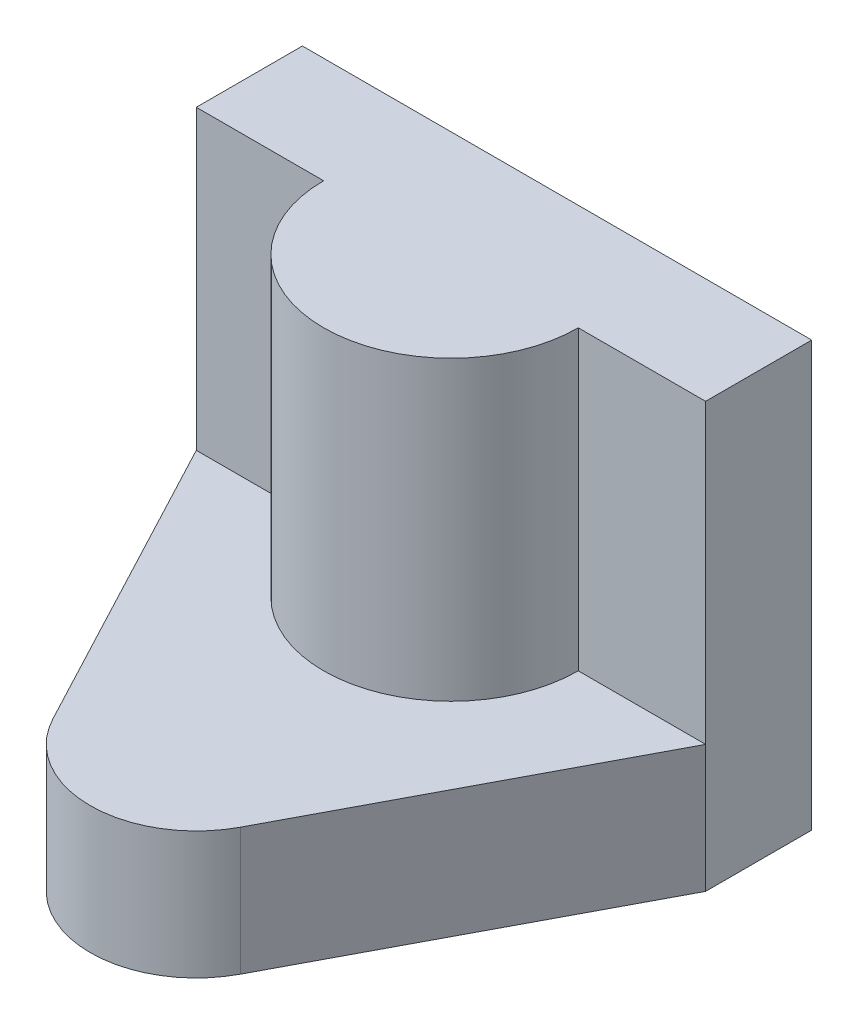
ISO-10303-21;
HEADER;
FILE_DESCRIPTION(('STEP AP214'),'2;1');
FILE_NAME('part.step','',(''),(''),'','','');
FILE_SCHEMA(('AUTOMOTIVE_DESIGN { 1 0 10303 214 1 1 1 1 }'));
ENDSEC;
DATA;
#1=APPLICATION_CONTEXT('core data for automotive mechanical design processes');
#2=APPLICATION_PROTOCOL_DEFINITION('international standard','automotive_design',2000,#1);
#3=PRODUCT_CONTEXT('',#1,'mechanical');
#4=PRODUCT('Part','Part','',(#3));
#5=PRODUCT_RELATED_PRODUCT_CATEGORY('part','',(#4));
#6=PRODUCT_DEFINITION_FORMATION('','',#4);
#7=PRODUCT_DEFINITION_CONTEXT('part definition',#1,'design');
#8=PRODUCT_DEFINITION('design','',#6,#7);
#9=PRODUCT_DEFINITION_SHAPE('','',#8);
#10=(LENGTH_UNIT() NAMED_UNIT(*) SI_UNIT(.MILLI.,.METRE.));
#11=(NAMED_UNIT(*) PLANE_ANGLE_UNIT() SI_UNIT($,.RADIAN.));
#12=(NAMED_UNIT(*) SI_UNIT($,.STERADIAN.) SOLID_ANGLE_UNIT());
#13=UNCERTAINTY_MEASURE_WITH_UNIT(LENGTH_MEASURE(1.E-05),#10,'distance_accuracy_value','');
#14=(GEOMETRIC_REPRESENTATION_CONTEXT(3) GLOBAL_UNCERTAINTY_ASSIGNED_CONTEXT((#13)) GLOBAL_UNIT_ASSIGNED_CONTEXT((#10,
#11,#12)) REPRESENTATION_CONTEXT('',''));
#15=CARTESIAN_POINT('',(0.,0.,0.));
#16=DIRECTION('',(0.,0.,1.));
#17=DIRECTION('',(1.,0.,0.));
#18=AXIS2_PLACEMENT_3D('',#15,#16,#17);
#19=CARTESIAN_POINT('',(-120.807449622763,100.,0.));
#20=DIRECTION('',(0.,0.,-1.));
#21=DIRECTION('',(-1.,0.,0.));
#22=AXIS2_PLACEMENT_3D('',#19,#20,#21);
#23=PLANE('',#22);
#24=DIRECTION('',(1.,0.,0.));
#25=VECTOR('',#24,1.);
#26=CARTESIAN_POINT('',(-120.807449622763,0.,0.));
#27=LINE('',#26,#25);
#28=CARTESIAN_POINT('',(-60.,0.,0.));
#29=VERTEX_POINT('',#28);
#30=CARTESIAN_POINT('',(60.,0.,0.));
#31=VERTEX_POINT('',#30);
#32=EDGE_CURVE('E115',#29,#31,#27,.T.);
#33=ORIENTED_EDGE('',*,*,#32,.F.);
#34=DIRECTION('',(0.,-1.,0.));
#35=VECTOR('',#34,1.);
#36=CARTESIAN_POINT('',(-60.,100.,0.));
#37=LINE('',#36,#35);
#38=CARTESIAN_POINT('',(-60.,100.,0.));
#39=VERTEX_POINT('',#38);
#40=EDGE_CURVE('E11',#39,#29,#37,.T.);
#41=ORIENTED_EDGE('',*,*,#40,.F.);
#42=DIRECTION('',(1.,0.,0.));
#43=VECTOR('',#42,1.);
#44=CARTESIAN_POINT('',(-120.807449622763,100.,0.));
#45=LINE('',#44,#43);
#46=CARTESIAN_POINT('',(60.,100.,0.));
#47=VERTEX_POINT('',#46);
#48=EDGE_CURVE('E123',#39,#47,#45,.T.);
#49=ORIENTED_EDGE('',*,*,#48,.T.);
#50=DIRECTION('',(0.,-1.,0.));
#51=VECTOR('',#50,1.);
#52=CARTESIAN_POINT('',(60.,100.,0.));
#53=LINE('',#52,#51);
#54=EDGE_CURVE('E46',#47,#31,#53,.T.);
#55=ORIENTED_EDGE('',*,*,#54,.T.);
#56=EDGE_LOOP('',(#33,#41,#49,#55));
#57=FACE_BOUND('',#56,.T.);
#58=ADVANCED_FACE('F30',(#57),#23,.T.);
#59=CARTESIAN_POINT('',(-60.,100.,48.8575845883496));
#60=DIRECTION('',(-1.,0.,0.));
#61=DIRECTION('',(0.,0.,1.));
#62=AXIS2_PLACEMENT_3D('',#59,#60,#61);
#63=PLANE('',#62);
#64=DIRECTION('',(0.,0.,-1.));
#65=VECTOR('',#64,1.);
#66=CARTESIAN_POINT('',(-60.,0.,48.8575845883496));
#67=LINE('',#66,#65);
#68=CARTESIAN_POINT('',(-60.,0.,25.));
#69=VERTEX_POINT('',#68);
#70=EDGE_CURVE('E117',#69,#29,#67,.T.);
#71=ORIENTED_EDGE('',*,*,#70,.F.);
#72=DIRECTION('',(0.,-1.,0.));
#73=VECTOR('',#72,1.);
#74=CARTESIAN_POINT('',(-60.,30.,25.));
#75=LINE('',#74,#73);
#76=CARTESIAN_POINT('',(-60.,30.,25.));
#77=VERTEX_POINT('',#76);
#78=EDGE_CURVE('E141',#77,#69,#75,.T.);
#79=ORIENTED_EDGE('',*,*,#78,.F.);
#80=DIRECTION('',(0.,-1.,0.));
#81=VECTOR('',#80,1.);
#82=CARTESIAN_POINT('',(-60.,100.,25.));
#83=LINE('',#82,#81);
#84=CARTESIAN_POINT('',(-60.,100.,25.));
#85=VERTEX_POINT('',#84);
#86=EDGE_CURVE('E38',#85,#77,#83,.T.);
#87=ORIENTED_EDGE('',*,*,#86,.F.);
#88=DIRECTION('',(0.,0.,-1.));
#89=VECTOR('',#88,1.);
#90=CARTESIAN_POINT('',(-60.,100.,48.8575845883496));
#91=LINE('',#90,#89);
#92=EDGE_CURVE('E140',#85,#39,#91,.T.);
#93=ORIENTED_EDGE('',*,*,#92,.T.);
#94=ORIENTED_EDGE('',*,*,#40,.T.);
#95=EDGE_LOOP('',(#71,#79,#87,#93,#94));
#96=FACE_BOUND('',#95,.T.);
#97=ADVANCED_FACE('F139',(#96),#63,.T.);
#98=CARTESIAN_POINT('',(-120.807449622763,100.,25.));
#99=DIRECTION('',(0.,0.,1.));
#100=DIRECTION('',(1.,0.,0.));
#101=AXIS2_PLACEMENT_3D('',#98,#99,#100);
#102=PLANE('',#101);
#103=DIRECTION('',(-1.,0.,0.));
#104=VECTOR('',#103,1.);
#105=CARTESIAN_POINT('',(-120.807449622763,30.,25.));
#106=LINE('',#105,#104);
#107=CARTESIAN_POINT('',(-30.,30.,25.));
#108=VERTEX_POINT('',#107);
#109=EDGE_CURVE('E133',#108,#77,#106,.T.);
#110=ORIENTED_EDGE('',*,*,#109,.F.);
#111=DIRECTION('',(0.,-1.,0.));
#112=VECTOR('',#111,1.);
#113=CARTESIAN_POINT('',(-30.,100.,25.));
#114=LINE('',#113,#112);
#115=CARTESIAN_POINT('',(-30.,100.,25.));
#116=VERTEX_POINT('',#115);
#117=EDGE_CURVE('E95',#116,#108,#114,.T.);
#118=ORIENTED_EDGE('',*,*,#117,.F.);
#119=DIRECTION('',(-1.,0.,0.));
#120=VECTOR('',#119,1.);
#121=CARTESIAN_POINT('',(-120.807449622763,100.,25.));
#122=LINE('',#121,#120);
#123=EDGE_CURVE('E106',#116,#85,#122,.T.);
#124=ORIENTED_EDGE('',*,*,#123,.T.);
#125=ORIENTED_EDGE('',*,*,#86,.T.);
#126=EDGE_LOOP('',(#110,#118,#124,#125));
#127=FACE_BOUND('',#126,.T.);
#128=ADVANCED_FACE('F130',(#127),#102,.T.);
#129=CARTESIAN_POINT('',(0.,100.,25.));
#130=DIRECTION('',(0.,-1.,0.));
#131=DIRECTION('',(0.,0.,-1.));
#132=AXIS2_PLACEMENT_3D('',#129,#130,#131);
#133=CYLINDRICAL_SURFACE('',#132,30.);
#134=CARTESIAN_POINT('',(0.,30.,25.));
#135=DIRECTION('',(0.,1.,0.));
#136=DIRECTION('',(0.,0.,1.));
#137=AXIS2_PLACEMENT_3D('',#134,#135,#136);
#138=CIRCLE('',#137,30.);
#139=CARTESIAN_POINT('',(30.,30.,25.));
#140=VERTEX_POINT('',#139);
#141=EDGE_CURVE('E91',#140,#108,#138,.F.);
#142=ORIENTED_EDGE('',*,*,#141,.F.);
#143=DIRECTION('',(0.,-1.,0.));
#144=VECTOR('',#143,1.);
#145=CARTESIAN_POINT('',(30.,100.,25.));
#146=LINE('',#145,#144);
#147=CARTESIAN_POINT('',(30.,100.,25.));
#148=VERTEX_POINT('',#147);
#149=EDGE_CURVE('E84',#148,#140,#146,.T.);
#150=ORIENTED_EDGE('',*,*,#149,.F.);
#151=CARTESIAN_POINT('',(0.,100.,25.));
#152=DIRECTION('',(0.,1.,0.));
#153=DIRECTION('',(0.,0.,1.));
#154=AXIS2_PLACEMENT_3D('',#151,#152,#153);
#155=CIRCLE('',#154,30.);
#156=EDGE_CURVE('E88',#148,#116,#155,.F.);
#157=ORIENTED_EDGE('',*,*,#156,.T.);
#158=ORIENTED_EDGE('',*,*,#117,.T.);
#159=EDGE_LOOP('',(#142,#150,#157,#158));
#160=FACE_BOUND('',#159,.T.);
#161=ADVANCED_FACE('F86',(#160),#133,.T.);
#162=CARTESIAN_POINT('',(-120.807449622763,100.,25.));
#163=DIRECTION('',(0.,0.,1.));
#164=DIRECTION('',(1.,0.,0.));
#165=AXIS2_PLACEMENT_3D('',#162,#163,#164);
#166=PLANE('',#165);
#167=DIRECTION('',(-1.,0.,0.));
#168=VECTOR('',#167,1.);
#169=CARTESIAN_POINT('',(-120.807449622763,30.,25.));
#170=LINE('',#169,#168);
#171=CARTESIAN_POINT('',(60.,30.,25.));
#172=VERTEX_POINT('',#171);
#173=EDGE_CURVE('E167',#172,#140,#170,.T.);
#174=ORIENTED_EDGE('',*,*,#173,.F.);
#175=DIRECTION('',(0.,-1.,0.));
#176=VECTOR('',#175,1.);
#177=CARTESIAN_POINT('',(60.,100.,25.));
#178=LINE('',#177,#176);
#179=CARTESIAN_POINT('',(60.,100.,25.));
#180=VERTEX_POINT('',#179);
#181=EDGE_CURVE('E96',#180,#172,#178,.T.);
#182=ORIENTED_EDGE('',*,*,#181,.F.);
#183=DIRECTION('',(-1.,0.,0.));
#184=VECTOR('',#183,1.);
#185=CARTESIAN_POINT('',(-120.807449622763,100.,25.));
#186=LINE('',#185,#184);
#187=EDGE_CURVE('E103',#180,#148,#186,.T.);
#188=ORIENTED_EDGE('',*,*,#187,.T.);
#189=ORIENTED_EDGE('',*,*,#149,.T.);
#190=EDGE_LOOP('',(#174,#182,#188,#189));
#191=FACE_BOUND('',#190,.T.);
#192=ADVANCED_FACE('F108',(#191),#166,.T.);
#193=CARTESIAN_POINT('',(60.,100.,48.8575845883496));
#194=DIRECTION('',(1.,0.,0.));
#195=DIRECTION('',(0.,0.,-1.));
#196=AXIS2_PLACEMENT_3D('',#193,#194,#195);
#197=PLANE('',#196);
#198=DIRECTION('',(0.,0.,1.));
#199=VECTOR('',#198,1.);
#200=CARTESIAN_POINT('',(60.,0.,48.8575845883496));
#201=LINE('',#200,#199);
#202=CARTESIAN_POINT('',(60.,0.,25.));
#203=VERTEX_POINT('',#202);
#204=EDGE_CURVE('E120',#31,#203,#201,.T.);
#205=ORIENTED_EDGE('',*,*,#204,.F.);
#206=ORIENTED_EDGE('',*,*,#54,.F.);
#207=DIRECTION('',(0.,0.,1.));
#208=VECTOR('',#207,1.);
#209=CARTESIAN_POINT('',(60.,100.,48.8575845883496));
#210=LINE('',#209,#208);
#211=EDGE_CURVE('E110',#47,#180,#210,.T.);
#212=ORIENTED_EDGE('',*,*,#211,.T.);
#213=ORIENTED_EDGE('',*,*,#181,.T.);
#214=DIRECTION('',(0.,-1.,0.));
#215=VECTOR('',#214,1.);
#216=CARTESIAN_POINT('',(60.,30.,25.));
#217=LINE('',#216,#215);
#218=EDGE_CURVE('E147',#172,#203,#217,.T.);
#219=ORIENTED_EDGE('',*,*,#218,.T.);
#220=EDGE_LOOP('',(#205,#206,#212,#213,#219));
#221=FACE_BOUND('',#220,.T.);
#222=ADVANCED_FACE('F197',(#221),#197,.T.);
#223=CARTESIAN_POINT('',(-120.807449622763,100.,48.8575845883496));
#224=DIRECTION('',(0.,1.,0.));
#225=DIRECTION('',(0.,0.,1.));
#226=AXIS2_PLACEMENT_3D('',#223,#224,#225);
#227=PLANE('',#226);
#228=ORIENTED_EDGE('',*,*,#48,.F.);
#229=ORIENTED_EDGE('',*,*,#92,.F.);
#230=ORIENTED_EDGE('',*,*,#123,.F.);
#231=ORIENTED_EDGE('',*,*,#156,.F.);
#232=ORIENTED_EDGE('',*,*,#187,.F.);
#233=ORIENTED_EDGE('',*,*,#211,.F.);
#234=EDGE_LOOP('',(#228,#229,#230,#231,#232,#233));
#235=FACE_BOUND('',#234,.T.);
#236=ADVANCED_FACE('F101',(#235),#227,.T.);
#237=CARTESIAN_POINT('',(-120.807449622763,0.,48.8575845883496));
#238=DIRECTION('',(0.,1.,0.));
#239=DIRECTION('',(0.,0.,1.));
#240=AXIS2_PLACEMENT_3D('',#237,#238,#239);
#241=PLANE('',#240);
#242=ORIENTED_EDGE('',*,*,#32,.T.);
#243=ORIENTED_EDGE('',*,*,#204,.T.);
#244=DIRECTION('',(0.467386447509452,0.,-0.884053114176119));
#245=VECTOR('',#244,1.);
#246=CARTESIAN_POINT('',(10.6447747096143,0.,118.354526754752));
#247=LINE('',#246,#245);
#248=CARTESIAN_POINT('',(22.101327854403,0.,96.6846611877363));
#249=VERTEX_POINT('',#248);
#250=EDGE_CURVE('E157',#249,#203,#247,.T.);
#251=ORIENTED_EDGE('',*,*,#250,.F.);
#252=CARTESIAN_POINT('',(0.,0.,85.));
#253=DIRECTION('',(0.,1.,0.));
#254=DIRECTION('',(0.,0.,1.));
#255=AXIS2_PLACEMENT_3D('',#252,#253,#254);
#256=CIRCLE('',#255,25.);
#257=CARTESIAN_POINT('',(-22.101327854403,0.,96.6846611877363));
#258=VERTEX_POINT('',#257);
#259=EDGE_CURVE('E160',#258,#249,#256,.T.);
#260=ORIENTED_EDGE('',*,*,#259,.F.);
#261=DIRECTION('',(0.467386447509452,0.,0.884053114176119));
#262=VECTOR('',#261,1.);
#263=CARTESIAN_POINT('',(-63.4255715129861,0.,18.5205926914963));
#264=LINE('',#263,#262);
#265=EDGE_CURVE('E61',#69,#258,#264,.T.);
#266=ORIENTED_EDGE('',*,*,#265,.F.);
#267=ORIENTED_EDGE('',*,*,#70,.T.);
#268=EDGE_LOOP('',(#242,#243,#251,#260,#266,#267));
#269=FACE_BOUND('',#268,.T.);
#270=ADVANCED_FACE('F198',(#269),#241,.F.);
#271=CARTESIAN_POINT('',(0.,30.,85.));
#272=DIRECTION('',(0.,-1.,0.));
#273=DIRECTION('',(0.,0.,-1.));
#274=AXIS2_PLACEMENT_3D('',#271,#272,#273);
#275=CYLINDRICAL_SURFACE('',#274,25.);
#276=ORIENTED_EDGE('',*,*,#259,.T.);
#277=DIRECTION('',(0.,-1.,0.));
#278=VECTOR('',#277,1.);
#279=CARTESIAN_POINT('',(22.101327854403,30.,96.6846611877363));
#280=LINE('',#279,#278);
#281=CARTESIAN_POINT('',(22.101327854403,30.,96.6846611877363));
#282=VERTEX_POINT('',#281);
#283=EDGE_CURVE('E118',#282,#249,#280,.T.);
#284=ORIENTED_EDGE('',*,*,#283,.F.);
#285=CARTESIAN_POINT('',(0.,30.,85.));
#286=DIRECTION('',(0.,1.,0.));
#287=DIRECTION('',(0.,0.,1.));
#288=AXIS2_PLACEMENT_3D('',#285,#286,#287);
#289=CIRCLE('',#288,25.);
#290=CARTESIAN_POINT('',(-22.101327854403,30.,96.6846611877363));
#291=VERTEX_POINT('',#290);
#292=EDGE_CURVE('E156',#291,#282,#289,.T.);
#293=ORIENTED_EDGE('',*,*,#292,.F.);
#294=DIRECTION('',(0.,-1.,0.));
#295=VECTOR('',#294,1.);
#296=CARTESIAN_POINT('',(-22.101327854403,30.,96.6846611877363));
#297=LINE('',#296,#295);
#298=EDGE_CURVE('E151',#291,#258,#297,.T.);
#299=ORIENTED_EDGE('',*,*,#298,.T.);
#300=EDGE_LOOP('',(#276,#284,#293,#299));
#301=FACE_BOUND('',#300,.T.);
#302=ADVANCED_FACE('F186',(#301),#275,.T.);
#303=CARTESIAN_POINT('',(10.6447747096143,30.,118.354526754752));
#304=DIRECTION('',(-0.884053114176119,0.,-0.467386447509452));
#305=DIRECTION('',(-0.467386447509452,0.,0.884053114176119));
#306=AXIS2_PLACEMENT_3D('',#303,#304,#305);
#307=PLANE('',#306);
#308=ORIENTED_EDGE('',*,*,#250,.T.);
#309=ORIENTED_EDGE('',*,*,#218,.F.);
#310=DIRECTION('',(0.467386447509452,0.,-0.884053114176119));
#311=VECTOR('',#310,1.);
#312=CARTESIAN_POINT('',(10.6447747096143,30.,118.354526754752));
#313=LINE('',#312,#311);
#314=EDGE_CURVE('E170',#282,#172,#313,.T.);
#315=ORIENTED_EDGE('',*,*,#314,.F.);
#316=ORIENTED_EDGE('',*,*,#283,.T.);
#317=EDGE_LOOP('',(#308,#309,#315,#316));
#318=FACE_BOUND('',#317,.T.);
#319=ADVANCED_FACE('F189',(#318),#307,.F.);
#320=CARTESIAN_POINT('',(-63.4255715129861,30.,18.5205926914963));
#321=DIRECTION('',(0.884053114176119,0.,-0.467386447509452));
#322=DIRECTION('',(-0.467386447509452,0.,-0.884053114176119));
#323=AXIS2_PLACEMENT_3D('',#320,#321,#322);
#324=PLANE('',#323);
#325=ORIENTED_EDGE('',*,*,#265,.T.);
#326=ORIENTED_EDGE('',*,*,#298,.F.);
#327=DIRECTION('',(0.467386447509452,0.,0.884053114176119));
#328=VECTOR('',#327,1.);
#329=CARTESIAN_POINT('',(-63.4255715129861,30.,18.5205926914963));
#330=LINE('',#329,#328);
#331=EDGE_CURVE('E154',#77,#291,#330,.T.);
#332=ORIENTED_EDGE('',*,*,#331,.F.);
#333=ORIENTED_EDGE('',*,*,#78,.T.);
#334=EDGE_LOOP('',(#325,#326,#332,#333));
#335=FACE_BOUND('',#334,.T.);
#336=ADVANCED_FACE('F222',(#335),#324,.F.);
#337=CARTESIAN_POINT('',(-120.807449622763,30.,48.8575845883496));
#338=DIRECTION('',(0.,1.,0.));
#339=DIRECTION('',(0.,0.,1.));
#340=AXIS2_PLACEMENT_3D('',#337,#338,#339);
#341=PLANE('',#340);
#342=ORIENTED_EDGE('',*,*,#292,.T.);
#343=ORIENTED_EDGE('',*,*,#314,.T.);
#344=ORIENTED_EDGE('',*,*,#173,.T.);
#345=ORIENTED_EDGE('',*,*,#141,.T.);
#346=ORIENTED_EDGE('',*,*,#109,.T.);
#347=ORIENTED_EDGE('',*,*,#331,.T.);
#348=EDGE_LOOP('',(#342,#343,#344,#345,#346,#347));
#349=FACE_BOUND('',#348,.T.);
#350=ADVANCED_FACE('F178',(#349),#341,.T.);
#351=CLOSED_SHELL('',(#58,#97,#128,#161,#192,#222,#236,#270,#302,#319,#336,#350));
#352=MANIFOLD_SOLID_BREP('B2',#351);
#353=ADVANCED_BREP_SHAPE_REPRESENTATION('',(#18,#352),#14);
#354=SHAPE_DEFINITION_REPRESENTATION(#9,#353);
ENDSEC;
END-ISO-10303-21;
